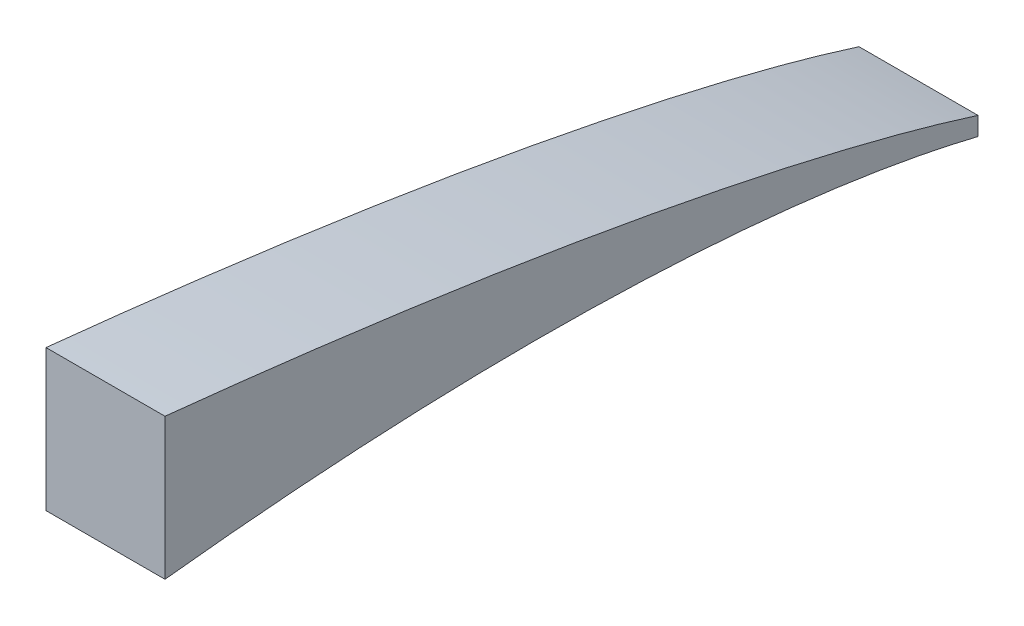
ISO-10303-21;
HEADER;
FILE_DESCRIPTION(('STEP AP214'),'2;1');
FILE_NAME('part.step','',(''),(''),'','','');
FILE_SCHEMA(('AUTOMOTIVE_DESIGN { 1 0 10303 214 1 1 1 1 }'));
ENDSEC;
DATA;
#1=APPLICATION_CONTEXT('core data for automotive mechanical design processes');
#2=APPLICATION_PROTOCOL_DEFINITION('international standard','automotive_design',2000,#1);
#3=PRODUCT_CONTEXT('',#1,'mechanical');
#4=PRODUCT('Part','Part','',(#3));
#5=PRODUCT_RELATED_PRODUCT_CATEGORY('part','',(#4));
#6=PRODUCT_DEFINITION_FORMATION('','',#4);
#7=PRODUCT_DEFINITION_CONTEXT('part definition',#1,'design');
#8=PRODUCT_DEFINITION('design','',#6,#7);
#9=PRODUCT_DEFINITION_SHAPE('','',#8);
#10=(LENGTH_UNIT() NAMED_UNIT(*) SI_UNIT(.MILLI.,.METRE.));
#11=(NAMED_UNIT(*) PLANE_ANGLE_UNIT() SI_UNIT($,.RADIAN.));
#12=(NAMED_UNIT(*) SI_UNIT($,.STERADIAN.) SOLID_ANGLE_UNIT());
#13=UNCERTAINTY_MEASURE_WITH_UNIT(LENGTH_MEASURE(1.E-05),#10,'distance_accuracy_value','');
#14=(GEOMETRIC_REPRESENTATION_CONTEXT(3) GLOBAL_UNCERTAINTY_ASSIGNED_CONTEXT((#13)) GLOBAL_UNIT_ASSIGNED_CONTEXT((#10,
#11,#12)) REPRESENTATION_CONTEXT('',''));
#15=CARTESIAN_POINT('',(0.,0.,0.));
#16=DIRECTION('',(0.,0.,1.));
#17=DIRECTION('',(1.,0.,0.));
#18=AXIS2_PLACEMENT_3D('',#15,#16,#17);
#19=CARTESIAN_POINT('',(9.525,6.66369888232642,-133.35));
#20=CARTESIAN_POINT('',(9.525,6.76675254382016,-133.02843554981));
#21=CARTESIAN_POINT('',(9.525,7.20907024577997,-131.624319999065));
#22=CARTESIAN_POINT('',(9.525,7.97363576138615,-129.022322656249));
#23=CARTESIAN_POINT('',(9.525,8.93748578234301,-125.436266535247));
#24=CARTESIAN_POINT('',(9.525,9.8985001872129,-121.543710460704));
#25=CARTESIAN_POINT('',(9.525,10.8497242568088,-117.366970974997));
#26=CARTESIAN_POINT('',(9.525,11.7852170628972,-112.93094238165));
#27=CARTESIAN_POINT('',(9.525,12.7001679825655,-108.26271343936));
#28=CARTESIAN_POINT('',(9.525,13.5833283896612,-103.389565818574));
#29=CARTESIAN_POINT('',(9.525,14.4334283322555,-98.3421881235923));
#30=CARTESIAN_POINT('',(9.525,15.2395335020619,-93.1496667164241));
#31=CARTESIAN_POINT('',(9.525,16.003202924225,-87.8455840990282));
#32=CARTESIAN_POINT('',(9.525,16.718387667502,-82.4639327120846));
#33=CARTESIAN_POINT('',(9.525,17.3827916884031,-77.0436928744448));
#34=CARTESIAN_POINT('',(9.525,17.9237404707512,-72.3056898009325));
#35=CARTESIAN_POINT('',(9.525,18.2331534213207,-69.3782748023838));
#36=CARTESIAN_POINT('',(9.525,18.3471431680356,-68.2625));
#37=B_SPLINE_CURVE_WITH_KNOTS('',3,(#19,#20,#21,#22,#23,#24,#25,#26,#27,#28,#29,#30,#31,#32,#33,
#34,#35,#36),.UNSPECIFIED.,.F.,.F.,(4,1,1,1,1,1,1,1,1,1,1,1,1,1,1,4),(1.04739946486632,
1.05071030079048,1.06183322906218,1.07398925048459,1.08711817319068,1.10114504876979,
1.11599063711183,1.13157042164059,1.14778837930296,1.16455091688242,1.18175789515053,
1.19931195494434,1.21709507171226,1.23499022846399,1.25285688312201,1.26385443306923),.UNSPECIFIED.);
#38=DIRECTION('',(-1.,0.,0.));
#39=VECTOR('',#38,1.);
#40=SURFACE_OF_LINEAR_EXTRUSION('',#37,#39);
#41=CARTESIAN_POINT('',(0.,6.66369888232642,-133.35));
#42=CARTESIAN_POINT('',(0.,6.76675254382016,-133.02843554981));
#43=CARTESIAN_POINT('',(0.,7.20907024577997,-131.624319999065));
#44=CARTESIAN_POINT('',(0.,7.97363576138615,-129.022322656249));
#45=CARTESIAN_POINT('',(0.,8.93748578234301,-125.436266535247));
#46=CARTESIAN_POINT('',(0.,9.8985001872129,-121.543710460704));
#47=CARTESIAN_POINT('',(0.,10.8497242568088,-117.366970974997));
#48=CARTESIAN_POINT('',(0.,11.7852170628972,-112.93094238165));
#49=CARTESIAN_POINT('',(0.,12.7001679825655,-108.26271343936));
#50=CARTESIAN_POINT('',(0.,13.5833283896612,-103.389565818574));
#51=CARTESIAN_POINT('',(0.,14.4334283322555,-98.3421881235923));
#52=CARTESIAN_POINT('',(0.,15.2395335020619,-93.1496667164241));
#53=CARTESIAN_POINT('',(0.,16.003202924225,-87.8455840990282));
#54=CARTESIAN_POINT('',(0.,16.718387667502,-82.4639327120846));
#55=CARTESIAN_POINT('',(0.,17.3827916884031,-77.0436928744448));
#56=CARTESIAN_POINT('',(0.,17.9237404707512,-72.3056898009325));
#57=CARTESIAN_POINT('',(0.,18.2331534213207,-69.3782748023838));
#58=CARTESIAN_POINT('',(0.,18.3471431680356,-68.2625));
#59=B_SPLINE_CURVE_WITH_KNOTS('',3,(#41,#42,#43,#44,#45,#46,#47,#48,#49,#50,#51,#52,#53,#54,#55,
#56,#57,#58),.UNSPECIFIED.,.F.,.F.,(4,1,1,1,1,1,1,1,1,1,1,1,1,1,1,4),(1.04739946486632,
1.05071030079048,1.06183322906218,1.07398925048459,1.08711817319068,1.10114504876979,
1.11599063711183,1.13157042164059,1.14778837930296,1.16455091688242,1.18175789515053,
1.19931195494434,1.21709507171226,1.23499022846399,1.25285688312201,1.26385443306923),.UNSPECIFIED.);
#60=CARTESIAN_POINT('',(0.,6.66369888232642,-133.35));
#61=VERTEX_POINT('',#60);
#62=CARTESIAN_POINT('',(0.,18.3471431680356,-68.2625));
#63=VERTEX_POINT('',#62);
#64=EDGE_CURVE('E118',#61,#63,#59,.T.);
#65=ORIENTED_EDGE('',*,*,#64,.T.);
#66=DIRECTION('',(-1.,0.,0.));
#67=VECTOR('',#66,1.);
#68=CARTESIAN_POINT('',(9.525,18.3471431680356,-68.2625));
#69=LINE('',#68,#67);
#70=CARTESIAN_POINT('',(9.525,18.3471431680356,-68.2625));
#71=VERTEX_POINT('',#70);
#72=EDGE_CURVE('E11',#71,#63,#69,.T.);
#73=ORIENTED_EDGE('',*,*,#72,.F.);
#74=CARTESIAN_POINT('',(9.525,6.66369888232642,-133.35));
#75=VERTEX_POINT('',#74);
#76=EDGE_CURVE('E87',#75,#71,#37,.T.);
#77=ORIENTED_EDGE('',*,*,#76,.F.);
#78=DIRECTION('',(-1.,0.,0.));
#79=VECTOR('',#78,1.);
#80=CARTESIAN_POINT('',(9.525,6.66369888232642,-133.35));
#81=LINE('',#80,#79);
#82=EDGE_CURVE('E95',#75,#61,#81,.T.);
#83=ORIENTED_EDGE('',*,*,#82,.T.);
#84=EDGE_LOOP('',(#65,#73,#77,#83));
#85=FACE_BOUND('',#84,.T.);
#86=ADVANCED_FACE('F35',(#85),#40,.F.);
#87=CARTESIAN_POINT('',(9.525,18.3471431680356,-68.2625));
#88=DIRECTION('',(0.,0.,-1.));
#89=DIRECTION('',(0.,1.,0.));
#90=AXIS2_PLACEMENT_3D('',#87,#88,#89);
#91=PLANE('',#90);
#92=DIRECTION('',(0.,-1.,0.));
#93=VECTOR('',#92,1.);
#94=CARTESIAN_POINT('',(0.,18.3471431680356,-68.2625));
#95=LINE('',#94,#93);
#96=CARTESIAN_POINT('',(0.,7.04085948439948,-68.2625));
#97=VERTEX_POINT('',#96);
#98=EDGE_CURVE('E91',#63,#97,#95,.T.);
#99=ORIENTED_EDGE('',*,*,#98,.T.);
#100=DIRECTION('',(-1.,0.,0.));
#101=VECTOR('',#100,1.);
#102=CARTESIAN_POINT('',(9.525,7.04085948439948,-68.2625));
#103=LINE('',#102,#101);
#104=CARTESIAN_POINT('',(9.525,7.04085948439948,-68.2625));
#105=VERTEX_POINT('',#104);
#106=EDGE_CURVE('E44',#105,#97,#103,.T.);
#107=ORIENTED_EDGE('',*,*,#106,.F.);
#108=DIRECTION('',(0.,-1.,0.));
#109=VECTOR('',#108,1.);
#110=CARTESIAN_POINT('',(9.525,18.3471431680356,-68.2625));
#111=LINE('',#110,#109);
#112=EDGE_CURVE('E82',#71,#105,#111,.T.);
#113=ORIENTED_EDGE('',*,*,#112,.F.);
#114=ORIENTED_EDGE('',*,*,#72,.T.);
#115=EDGE_LOOP('',(#99,#107,#113,#114));
#116=FACE_BOUND('',#115,.T.);
#117=ADVANCED_FACE('F90',(#116),#91,.F.);
#118=CARTESIAN_POINT('',(9.525,7.04085948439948,-68.2625));
#119=CARTESIAN_POINT('',(9.525,7.21039333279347,-69.7819864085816));
#120=CARTESIAN_POINT('',(9.525,7.61144338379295,-73.6250446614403));
#121=CARTESIAN_POINT('',(9.525,8.13388178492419,-79.8029132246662));
#122=CARTESIAN_POINT('',(9.525,8.55029058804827,-86.7743590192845));
#123=CARTESIAN_POINT('',(9.525,8.77815331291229,-93.6864135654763));
#124=CARTESIAN_POINT('',(9.525,8.80490104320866,-100.464089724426));
#125=CARTESIAN_POINT('',(9.525,8.62858387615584,-107.03177133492));
#126=CARTESIAN_POINT('',(9.525,8.25330238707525,-113.314255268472));
#127=CARTESIAN_POINT('',(9.525,7.6838968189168,-119.235995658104));
#128=CARTESIAN_POINT('',(9.525,6.9421697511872,-124.726495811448));
#129=CARTESIAN_POINT('',(9.525,6.10829641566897,-129.386341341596));
#130=CARTESIAN_POINT('',(9.525,5.47878605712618,-132.199931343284));
#131=CARTESIAN_POINT('',(9.525,5.19548158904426,-133.35));
#132=B_SPLINE_CURVE_WITH_KNOTS('',3,(#118,#119,#120,#121,#122,#123,#124,#125,#126,#127,#128,
#129,#130,#131),.UNSPECIFIED.,.F.,.F.,(4,1,1,1,1,1,1,1,1,1,1,4),(0.741102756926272,
0.756094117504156,0.778988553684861,0.801889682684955,0.824566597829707,0.846792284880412,
0.868338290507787,0.888978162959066,0.908492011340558,0.926658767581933,0.943286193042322,
0.954903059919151),.UNSPECIFIED.);
#133=DIRECTION('',(-1.,0.,0.));
#134=VECTOR('',#133,1.);
#135=SURFACE_OF_LINEAR_EXTRUSION('',#132,#134);
#136=CARTESIAN_POINT('',(0.,7.04085948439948,-68.2625));
#137=CARTESIAN_POINT('',(0.,7.21039333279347,-69.7819864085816));
#138=CARTESIAN_POINT('',(0.,7.61144338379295,-73.6250446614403));
#139=CARTESIAN_POINT('',(0.,8.13388178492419,-79.8029132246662));
#140=CARTESIAN_POINT('',(0.,8.55029058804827,-86.7743590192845));
#141=CARTESIAN_POINT('',(0.,8.77815331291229,-93.6864135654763));
#142=CARTESIAN_POINT('',(0.,8.80490104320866,-100.464089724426));
#143=CARTESIAN_POINT('',(0.,8.62858387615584,-107.03177133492));
#144=CARTESIAN_POINT('',(0.,8.25330238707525,-113.314255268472));
#145=CARTESIAN_POINT('',(0.,7.6838968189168,-119.235995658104));
#146=CARTESIAN_POINT('',(0.,6.9421697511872,-124.726495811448));
#147=CARTESIAN_POINT('',(0.,6.10829641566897,-129.386341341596));
#148=CARTESIAN_POINT('',(0.,5.47878605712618,-132.199931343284));
#149=CARTESIAN_POINT('',(0.,5.19548158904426,-133.35));
#150=B_SPLINE_CURVE_WITH_KNOTS('',3,(#136,#137,#138,#139,#140,#141,#142,#143,#144,#145,#146,
#147,#148,#149),.UNSPECIFIED.,.F.,.F.,(4,1,1,1,1,1,1,1,1,1,1,4),(0.741102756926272,
0.756094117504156,0.778988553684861,0.801889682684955,0.824566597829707,0.846792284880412,
0.868338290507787,0.888978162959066,0.908492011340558,0.926658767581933,0.943286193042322,
0.954903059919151),.UNSPECIFIED.);
#151=CARTESIAN_POINT('',(0.,5.19548158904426,-133.35));
#152=VERTEX_POINT('',#151);
#153=EDGE_CURVE('E69',#97,#152,#150,.T.);
#154=ORIENTED_EDGE('',*,*,#153,.T.);
#155=DIRECTION('',(-1.,0.,0.));
#156=VECTOR('',#155,1.);
#157=CARTESIAN_POINT('',(9.525,5.19548158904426,-133.35));
#158=LINE('',#157,#156);
#159=CARTESIAN_POINT('',(9.525,5.19548158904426,-133.35));
#160=VERTEX_POINT('',#159);
#161=EDGE_CURVE('E92',#160,#152,#158,.T.);
#162=ORIENTED_EDGE('',*,*,#161,.F.);
#163=EDGE_CURVE('E85',#105,#160,#132,.T.);
#164=ORIENTED_EDGE('',*,*,#163,.F.);
#165=ORIENTED_EDGE('',*,*,#106,.T.);
#166=EDGE_LOOP('',(#154,#162,#164,#165));
#167=FACE_BOUND('',#166,.T.);
#168=ADVANCED_FACE('F93',(#167),#135,.F.);
#169=CARTESIAN_POINT('',(9.525,6.66369888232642,-133.35));
#170=DIRECTION('',(0.,0.,1.));
#171=DIRECTION('',(1.,0.,0.));
#172=AXIS2_PLACEMENT_3D('',#169,#170,#171);
#173=PLANE('',#172);
#174=DIRECTION('',(0.,1.,0.));
#175=VECTOR('',#174,1.);
#176=CARTESIAN_POINT('',(0.,6.66369888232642,-133.35));
#177=LINE('',#176,#175);
#178=EDGE_CURVE('E75',#152,#61,#177,.T.);
#179=ORIENTED_EDGE('',*,*,#178,.T.);
#180=ORIENTED_EDGE('',*,*,#82,.F.);
#181=DIRECTION('',(0.,1.,0.));
#182=VECTOR('',#181,1.);
#183=CARTESIAN_POINT('',(9.525,6.66369888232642,-133.35));
#184=LINE('',#183,#182);
#185=EDGE_CURVE('E52',#160,#75,#184,.T.);
#186=ORIENTED_EDGE('',*,*,#185,.F.);
#187=ORIENTED_EDGE('',*,*,#161,.T.);
#188=EDGE_LOOP('',(#179,#180,#186,#187));
#189=FACE_BOUND('',#188,.T.);
#190=ADVANCED_FACE('F107',(#189),#173,.F.);
#191=CARTESIAN_POINT('',(9.525,13.96972600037,-101.0788916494));
#192=DIRECTION('',(-1.,0.,0.));
#193=DIRECTION('',(0.,0.,1.));
#194=AXIS2_PLACEMENT_3D('',#191,#192,#193);
#195=PLANE('',#194);
#196=ORIENTED_EDGE('',*,*,#76,.T.);
#197=ORIENTED_EDGE('',*,*,#112,.T.);
#198=ORIENTED_EDGE('',*,*,#163,.T.);
#199=ORIENTED_EDGE('',*,*,#185,.T.);
#200=EDGE_LOOP('',(#196,#197,#198,#199));
#201=FACE_BOUND('',#200,.T.);
#202=ADVANCED_FACE('F83',(#201),#195,.F.);
#203=CARTESIAN_POINT('',(0.,13.96972600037,-101.0788916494));
#204=DIRECTION('',(-1.,0.,0.));
#205=DIRECTION('',(0.,0.,1.));
#206=AXIS2_PLACEMENT_3D('',#203,#204,#205);
#207=PLANE('',#206);
#208=ORIENTED_EDGE('',*,*,#64,.F.);
#209=ORIENTED_EDGE('',*,*,#178,.F.);
#210=ORIENTED_EDGE('',*,*,#153,.F.);
#211=ORIENTED_EDGE('',*,*,#98,.F.);
#212=EDGE_LOOP('',(#208,#209,#210,#211));
#213=FACE_BOUND('',#212,.T.);
#214=ADVANCED_FACE('F135',(#213),#207,.T.);
#215=CLOSED_SHELL('',(#86,#117,#168,#190,#202,#214));
#216=MANIFOLD_SOLID_BREP('B2',#215);
#217=ADVANCED_BREP_SHAPE_REPRESENTATION('',(#18,#216),#14);
#218=SHAPE_DEFINITION_REPRESENTATION(#9,#217);
ENDSEC;
END-ISO-10303-21;
